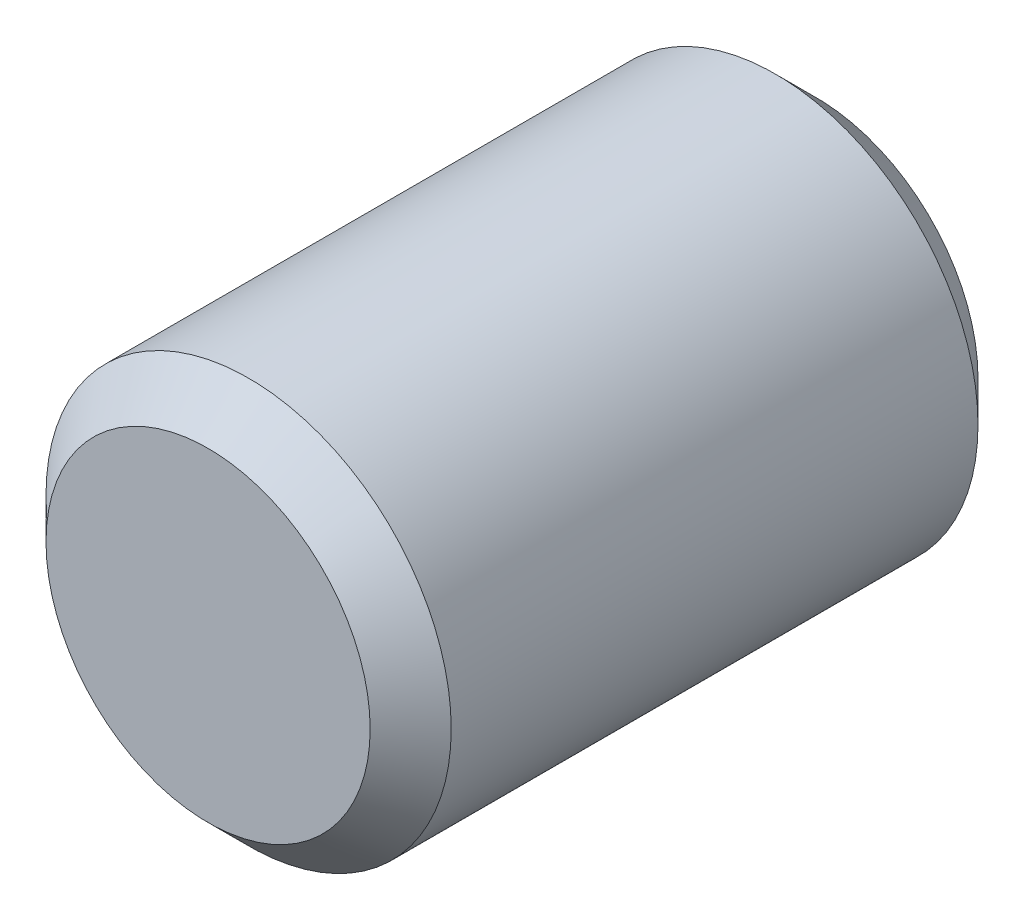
from build123d import *

# Parameters (mm, degrees)
ESQUISSE1_R          = 5
BASE_EXTRUSION_DEPTH = 15
CHANFREIN1_SIZE      = 1


with BuildPart() as part:
    # Esquisse1 → Base-Extrusion (new body)
    with BuildSketch(Plane.XY):
        Circle(ESQUISSE1_R)
    extrude(amount=BASE_EXTRUSION_DEPTH)

    # Chanfrein1
    chanfrein1_edges = [part.edges().sort_by_distance(p)[0] for p in [
        (-5, 0, 0),
        (-5, 0, 15),
    ]]
    chamfer(chanfrein1_edges, length=CHANFREIN1_SIZE)


solid = part.part
